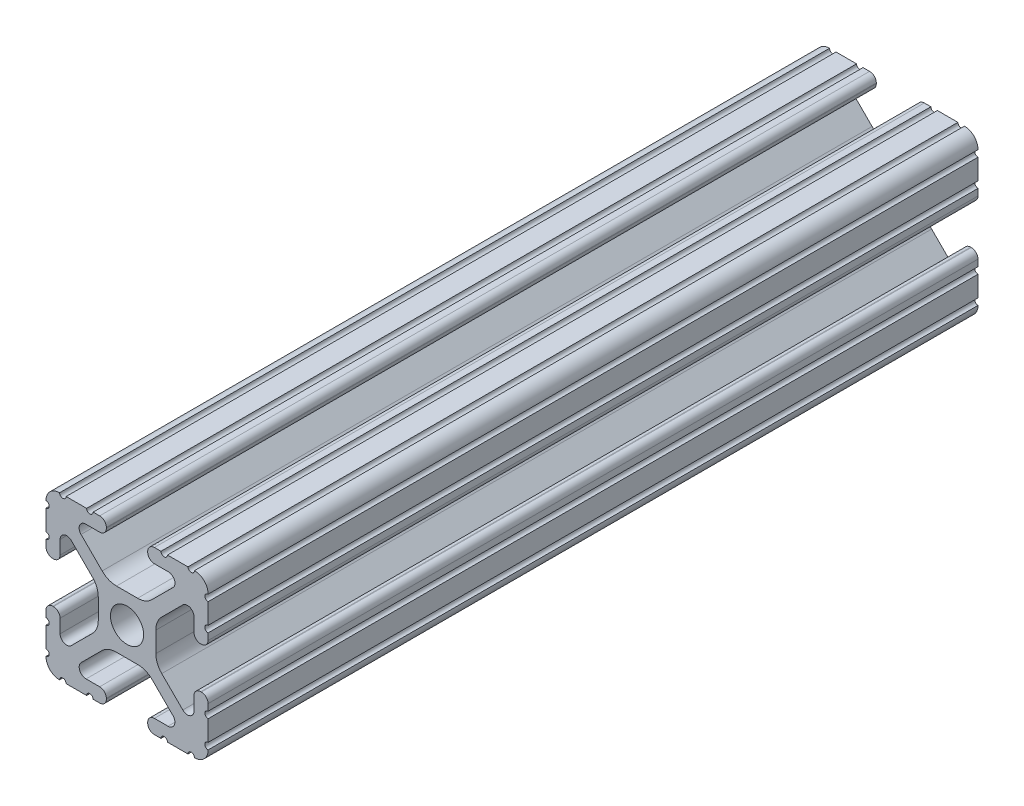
from build123d import *

# Parameters (mm, degrees)
SKETCH1_R           = 2.6035
BOSS_EXTRUDE1_DEPTH = 60.325


with BuildPart() as part:
    # Sketch1 → Boss-Extrude1 (new, symmetric)
    with BuildSketch(Plane.XY):
        with BuildLine():
            Line((-7.179650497, -8.645192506), (-3.952270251, -5.423690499))
            ThreePointArc((-3.952270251, -5.423690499), (-2.922936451, -4.736929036), (-1.709253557, -4.4958))
            Line((-1.709253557, -4.4958), (1.709253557, -4.4958))
            ThreePointArc((1.709253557, -4.4958), (2.922936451, -4.736929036), (3.952270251, -5.423690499))
            Line((3.952270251, -5.423690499), (7.179650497, -8.645192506))
            ThreePointArc((7.179650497, -8.645192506), (7.41473083, -9.822813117), (6.416408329, -10.4902))
            Line((6.416408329, -10.4902), (4.287512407, -10.4902))
            ThreePointArc((4.287512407, -10.4902), (3.54574862, -10.79744862), (3.2385, -11.539212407))
            Line((3.2385, -11.539212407), (3.2385, -11.650987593))
            ThreePointArc((3.2385, -11.650987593), (3.54574862, -12.39275138), (4.287512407, -12.7))
            Line((4.287512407, -12.7), (5.317126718, -12.7))
            ThreePointArc((5.317126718, -12.7), (5.825126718, -12.192), (6.333126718, -12.7))
            Line((6.333126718, -12.7), (9.550443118, -12.7))
            ThreePointArc((9.550443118, -12.7), (10.058366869, -12.192000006), (10.566443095, -12.699847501))
            ThreePointArc((10.566443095, -12.699847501), (12.082537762, -12.08250727), (12.699846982, -10.566399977))
            ThreePointArc((12.699846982, -10.566399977), (12.192000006, -10.058323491), (12.7, -9.5504))
            Line((12.7, -9.5504), (12.7, -6.3330836))
            ThreePointArc((12.7, -6.3330836), (12.192, -5.8250836), (12.7, -5.3170836))
            Line((12.7, -5.3170836), (12.7, -4.287469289))
            ThreePointArc((12.7, -4.287469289), (12.39275138, -3.545705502), (11.650987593, -3.238456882))
            Line((11.650987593, -3.238456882), (11.539212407, -3.238456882))
            ThreePointArc((11.539212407, -3.238456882), (10.79744862, -3.545705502), (10.4902, -4.287469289))
            Line((10.4902, -4.287469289), (10.4902, -6.402089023))
            ThreePointArc((10.4902, -6.402089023), (9.856505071, -7.351067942), (8.737131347, -7.129408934))
            Line((8.737131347, -7.129408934), (5.441005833, -3.840816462))
            ThreePointArc((5.441005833, -3.840816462), (4.750877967, -2.809883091), (4.5085, -1.593185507))
            Line((4.5085, -1.593185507), (4.5085, 1.593185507))
            ThreePointArc((4.5085, 1.593185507), (4.750877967, 2.809883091), (5.441005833, 3.840816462))
            Line((5.441005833, 3.840816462), (8.737131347, 7.129408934))
            ThreePointArc((8.737131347, 7.129408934), (9.856505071, 7.351067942), (10.4902, 6.402089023))
            Line((10.4902, 6.402089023), (10.4902, 4.287469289))
            ThreePointArc((10.4902, 4.287469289), (10.79744862, 3.545705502), (11.539212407, 3.238456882))
            Line((11.539212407, 3.238456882), (11.650987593, 3.238456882))
            ThreePointArc((11.650987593, 3.238456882), (12.39275138, 3.545705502), (12.7, 4.287469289))
            Line((12.7, 4.287469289), (12.7, 5.3170836))
            ThreePointArc((12.7, 5.3170836), (12.192, 5.8250836), (12.7, 6.3330836))
            Line((12.7, 6.3330836), (12.7, 9.5504))
            ThreePointArc((12.7, 9.5504), (12.192000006, 10.058323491), (12.699846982, 10.566399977))
            ThreePointArc((12.699846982, 10.566399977), (12.082537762, 12.08250727), (10.566443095, 12.699847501))
            ThreePointArc((10.566443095, 12.699847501), (10.058366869, 12.192000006), (9.550443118, 12.7))
            Line((9.550443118, 12.7), (6.333126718, 12.7))
            ThreePointArc((6.333126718, 12.7), (5.825126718, 12.192), (5.317126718, 12.7))
            Line((5.317126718, 12.7), (4.287512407, 12.7))
            ThreePointArc((4.287512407, 12.7), (3.54574862, 12.39275138), (3.2385, 11.650987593))
            Line((3.2385, 11.650987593), (3.2385, 11.539212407))
            ThreePointArc((3.2385, 11.539212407), (3.54574862, 10.79744862), (4.287512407, 10.4902))
            Line((4.287512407, 10.4902), (6.476788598, 10.4902))
            ThreePointArc((6.476788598, 10.4902), (7.432222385, 9.85140422), (7.207036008, 8.724370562))
            Line((7.207036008, 8.724370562), (3.898272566, 5.423169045))
            ThreePointArc((3.898272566, 5.423169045), (2.869120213, 4.736787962), (1.655778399, 4.4958))
            Line((1.655778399, 4.4958), (-1.655778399, 4.4958))
            ThreePointArc((-1.655778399, 4.4958), (-2.869120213, 4.736787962), (-3.898272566, 5.423169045))
            Line((-3.898272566, 5.423169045), (-7.207036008, 8.724370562))
            ThreePointArc((-7.207036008, 8.724370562), (-7.432222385, 9.85140422), (-6.476788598, 10.4902))
            Line((-6.476788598, 10.4902), (-4.287512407, 10.4902))
            ThreePointArc((-4.287512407, 10.4902), (-3.54574862, 10.79744862), (-3.2385, 11.539212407))
            Line((-3.2385, 11.539212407), (-3.2385, 11.650987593))
            ThreePointArc((-3.2385, 11.650987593), (-3.54574862, 12.39275138), (-4.287512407, 12.7))
            Line((-4.287512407, 12.7), (-5.317126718, 12.7))
            ThreePointArc((-5.317126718, 12.7), (-5.825126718, 12.192), (-6.333126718, 12.7))
            Line((-6.333126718, 12.7), (-9.550443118, 12.7))
            ThreePointArc((-9.550443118, 12.7), (-10.058366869, 12.192000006), (-10.566443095, 12.699847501))
            ThreePointArc((-10.566443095, 12.699847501), (-12.082537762, 12.08250727), (-12.699846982, 10.566399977))
            ThreePointArc((-12.699846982, 10.566399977), (-12.192000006, 10.058323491), (-12.7, 9.5504))
            Line((-12.7, 9.5504), (-12.7, 6.3330836))
            ThreePointArc((-12.7, 6.3330836), (-12.192, 5.8250836), (-12.7, 5.3170836))
            Line((-12.7, 5.3170836), (-12.7, 4.287469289))
            ThreePointArc((-12.7, 4.287469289), (-12.39275138, 3.545705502), (-11.650987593, 3.238456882))
            Line((-11.650987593, 3.238456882), (-11.539212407, 3.238456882))
            ThreePointArc((-11.539212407, 3.238456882), (-10.79744862, 3.545705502), (-10.4902, 4.287469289))
            Line((-10.4902, 4.287469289), (-10.4902, 6.402089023))
            ThreePointArc((-10.4902, 6.402089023), (-9.856505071, 7.351067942), (-8.737131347, 7.129408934))
            Line((-8.737131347, 7.129408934), (-5.441005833, 3.840816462))
            ThreePointArc((-5.441005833, 3.840816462), (-4.750877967, 2.809883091), (-4.5085, 1.593185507))
            Line((-4.5085, 1.593185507), (-4.5085, -1.593185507))
            ThreePointArc((-4.5085, -1.593185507), (-4.750877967, -2.809883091), (-5.441005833, -3.840816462))
            Line((-5.441005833, -3.840816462), (-8.737131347, -7.129408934))
            ThreePointArc((-8.737131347, -7.129408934), (-9.856505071, -7.351067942), (-10.4902, -6.402089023))
            Line((-10.4902, -6.402089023), (-10.4902, -4.287469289))
            ThreePointArc((-10.4902, -4.287469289), (-10.79744862, -3.545705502), (-11.539212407, -3.238456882))
            Line((-11.539212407, -3.238456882), (-11.650987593, -3.238456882))
            ThreePointArc((-11.650987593, -3.238456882), (-12.39275138, -3.545705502), (-12.7, -4.287469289))
            Line((-12.7, -4.287469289), (-12.7, -5.3170836))
            ThreePointArc((-12.7, -5.3170836), (-12.192, -5.8250836), (-12.7, -6.3330836))
            Line((-12.7, -6.3330836), (-12.7, -9.5504))
            ThreePointArc((-12.7, -9.5504), (-12.192000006, -10.058323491), (-12.699846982, -10.566399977))
            ThreePointArc((-12.699846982, -10.566399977), (-12.082537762, -12.08250727), (-10.566443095, -12.699847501))
            ThreePointArc((-10.566443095, -12.699847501), (-10.058366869, -12.192000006), (-9.550443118, -12.7))
            Line((-9.550443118, -12.7), (-6.333126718, -12.7))
            ThreePointArc((-6.333126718, -12.7), (-5.825126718, -12.192), (-5.317126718, -12.7))
            Line((-5.317126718, -12.7), (-4.287512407, -12.7))
            ThreePointArc((-4.287512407, -12.7), (-3.54574862, -12.39275138), (-3.2385, -11.650987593))
            Line((-3.2385, -11.650987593), (-3.2385, -11.539212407))
            ThreePointArc((-3.2385, -11.539212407), (-3.54574862, -10.79744862), (-4.287512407, -10.4902))
            Line((-4.287512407, -10.4902), (-6.416408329, -10.4902))
            ThreePointArc((-6.416408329, -10.4902), (-7.41473083, -9.822813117), (-7.179650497, -8.645192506))
        make_face()
        with Locations(Location((0, 0, 0), (0, 0, 180))):
            Circle(SKETCH1_R, mode=Mode.SUBTRACT)
    extrude(amount=BOSS_EXTRUDE1_DEPTH, both=True)


solid = part.part
